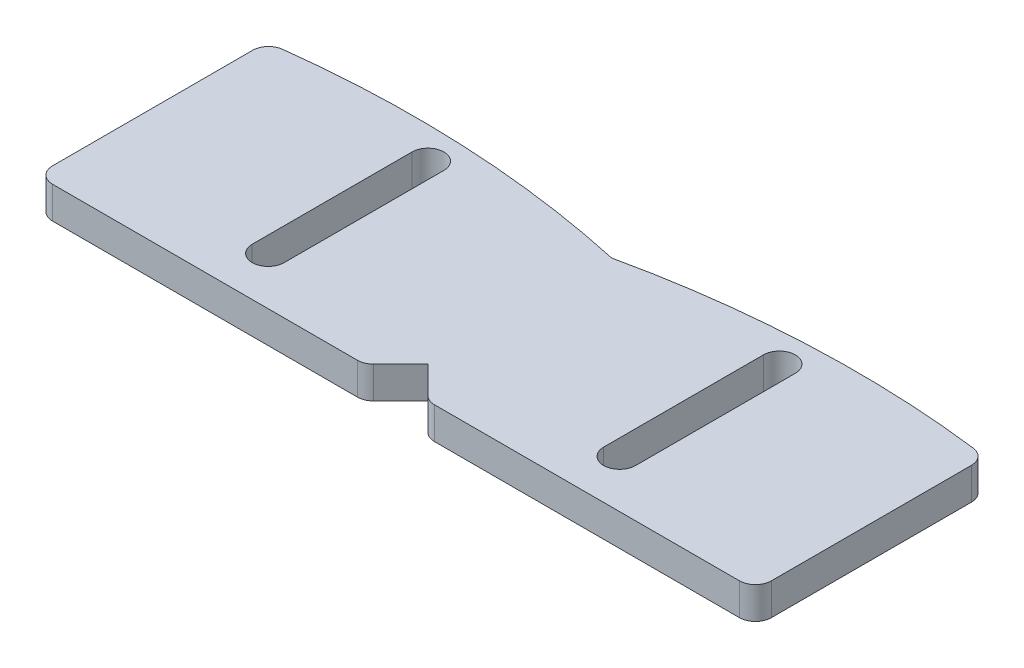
ISO-10303-21;
HEADER;
FILE_DESCRIPTION(('STEP AP214'),'2;1');
FILE_NAME('part.step','',(''),(''),'','','');
FILE_SCHEMA(('AUTOMOTIVE_DESIGN { 1 0 10303 214 1 1 1 1 }'));
ENDSEC;
DATA;
#1=APPLICATION_CONTEXT('core data for automotive mechanical design processes');
#2=APPLICATION_PROTOCOL_DEFINITION('international standard','automotive_design',2000,#1);
#3=PRODUCT_CONTEXT('',#1,'mechanical');
#4=PRODUCT('Part','Part','',(#3));
#5=PRODUCT_RELATED_PRODUCT_CATEGORY('part','',(#4));
#6=PRODUCT_DEFINITION_FORMATION('','',#4);
#7=PRODUCT_DEFINITION_CONTEXT('part definition',#1,'design');
#8=PRODUCT_DEFINITION('design','',#6,#7);
#9=PRODUCT_DEFINITION_SHAPE('','',#8);
#10=(LENGTH_UNIT() NAMED_UNIT(*) SI_UNIT(.MILLI.,.METRE.));
#11=(NAMED_UNIT(*) PLANE_ANGLE_UNIT() SI_UNIT($,.RADIAN.));
#12=(NAMED_UNIT(*) SI_UNIT($,.STERADIAN.) SOLID_ANGLE_UNIT());
#13=UNCERTAINTY_MEASURE_WITH_UNIT(LENGTH_MEASURE(1.E-05),#10,'distance_accuracy_value','');
#14=(GEOMETRIC_REPRESENTATION_CONTEXT(3) GLOBAL_UNCERTAINTY_ASSIGNED_CONTEXT((#13)) GLOBAL_UNIT_ASSIGNED_CONTEXT((#10,
#11,#12)) REPRESENTATION_CONTEXT('',''));
#15=CARTESIAN_POINT('',(0.,0.,0.));
#16=DIRECTION('',(0.,0.,1.));
#17=DIRECTION('',(1.,0.,0.));
#18=AXIS2_PLACEMENT_3D('',#15,#16,#17);
#19=CARTESIAN_POINT('',(12.,2.,0.));
#20=DIRECTION('',(1.,0.,0.));
#21=DIRECTION('',(0.,0.,-1.));
#22=AXIS2_PLACEMENT_3D('',#19,#20,#21);
#23=PLANE('',#22);
#24=DIRECTION('',(0.,0.,1.));
#25=VECTOR('',#24,1.);
#26=CARTESIAN_POINT('',(12.,0.,0.));
#27=LINE('',#26,#25);
#28=CARTESIAN_POINT('',(12.,0.,-5.5));
#29=VERTEX_POINT('',#28);
#30=CARTESIAN_POINT('',(12.,0.,4.5));
#31=VERTEX_POINT('',#30);
#32=EDGE_CURVE('E276',#29,#31,#27,.T.);
#33=ORIENTED_EDGE('',*,*,#32,.T.);
#34=DIRECTION('',(0.,-1.,0.));
#35=VECTOR('',#34,1.);
#36=CARTESIAN_POINT('',(12.,2.,4.5));
#37=LINE('',#36,#35);
#38=CARTESIAN_POINT('',(12.,2.,4.5));
#39=VERTEX_POINT('',#38);
#40=EDGE_CURVE('E294',#39,#31,#37,.T.);
#41=ORIENTED_EDGE('',*,*,#40,.F.);
#42=DIRECTION('',(0.,0.,1.));
#43=VECTOR('',#42,1.);
#44=CARTESIAN_POINT('',(12.,2.,0.));
#45=LINE('',#44,#43);
#46=CARTESIAN_POINT('',(12.,2.,-5.5));
#47=VERTEX_POINT('',#46);
#48=EDGE_CURVE('E234',#47,#39,#45,.T.);
#49=ORIENTED_EDGE('',*,*,#48,.F.);
#50=DIRECTION('',(0.,-1.,0.));
#51=VECTOR('',#50,1.);
#52=CARTESIAN_POINT('',(12.,2.,-5.5));
#53=LINE('',#52,#51);
#54=EDGE_CURVE('E286',#47,#29,#53,.T.);
#55=ORIENTED_EDGE('',*,*,#54,.T.);
#56=EDGE_LOOP('',(#33,#41,#49,#55));
#57=FACE_BOUND('',#56,.T.);
#58=ADVANCED_FACE('F34',(#57),#23,.F.);
#59=CARTESIAN_POINT('',(11.,2.,4.5));
#60=DIRECTION('',(0.,-1.,0.));
#61=DIRECTION('',(0.,0.,-1.));
#62=AXIS2_PLACEMENT_3D('',#59,#60,#61);
#63=CYLINDRICAL_SURFACE('',#62,0.999999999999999);
#64=CARTESIAN_POINT('',(11.,0.,4.5));
#65=DIRECTION('',(0.,1.,0.));
#66=DIRECTION('',(0.,0.,1.));
#67=AXIS2_PLACEMENT_3D('',#64,#65,#66);
#68=CIRCLE('',#67,0.999999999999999);
#69=CARTESIAN_POINT('',(10.,0.,4.5));
#70=VERTEX_POINT('',#69);
#71=EDGE_CURVE('E279',#31,#70,#68,.F.);
#72=ORIENTED_EDGE('',*,*,#71,.T.);
#73=DIRECTION('',(0.,-1.,0.));
#74=VECTOR('',#73,1.);
#75=CARTESIAN_POINT('',(10.,2.,4.5));
#76=LINE('',#75,#74);
#77=CARTESIAN_POINT('',(10.,2.,4.5));
#78=VERTEX_POINT('',#77);
#79=EDGE_CURVE('E292',#78,#70,#76,.T.);
#80=ORIENTED_EDGE('',*,*,#79,.F.);
#81=CARTESIAN_POINT('',(11.,2.,4.5));
#82=DIRECTION('',(0.,1.,0.));
#83=DIRECTION('',(0.,0.,1.));
#84=AXIS2_PLACEMENT_3D('',#81,#82,#83);
#85=CIRCLE('',#84,0.999999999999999);
#86=EDGE_CURVE('E237',#39,#78,#85,.F.);
#87=ORIENTED_EDGE('',*,*,#86,.F.);
#88=ORIENTED_EDGE('',*,*,#40,.T.);
#89=EDGE_LOOP('',(#72,#80,#87,#88));
#90=FACE_BOUND('',#89,.T.);
#91=ADVANCED_FACE('F419',(#90),#63,.F.);
#92=CARTESIAN_POINT('',(10.,2.,0.));
#93=DIRECTION('',(1.,0.,0.));
#94=DIRECTION('',(0.,0.,-1.));
#95=AXIS2_PLACEMENT_3D('',#92,#93,#94);
#96=PLANE('',#95);
#97=DIRECTION('',(0.,0.,1.));
#98=VECTOR('',#97,1.);
#99=CARTESIAN_POINT('',(10.,0.,0.));
#100=LINE('',#99,#98);
#101=CARTESIAN_POINT('',(10.,0.,-5.5));
#102=VERTEX_POINT('',#101);
#103=EDGE_CURVE('E282',#102,#70,#100,.T.);
#104=ORIENTED_EDGE('',*,*,#103,.F.);
#105=DIRECTION('',(0.,-1.,0.));
#106=VECTOR('',#105,1.);
#107=CARTESIAN_POINT('',(10.,2.,-5.5));
#108=LINE('',#107,#106);
#109=CARTESIAN_POINT('',(10.,2.,-5.5));
#110=VERTEX_POINT('',#109);
#111=EDGE_CURVE('E289',#110,#102,#108,.T.);
#112=ORIENTED_EDGE('',*,*,#111,.F.);
#113=DIRECTION('',(0.,0.,1.));
#114=VECTOR('',#113,1.);
#115=CARTESIAN_POINT('',(10.,2.,0.));
#116=LINE('',#115,#114);
#117=EDGE_CURVE('E239',#110,#78,#116,.T.);
#118=ORIENTED_EDGE('',*,*,#117,.T.);
#119=ORIENTED_EDGE('',*,*,#79,.T.);
#120=EDGE_LOOP('',(#104,#112,#118,#119));
#121=FACE_BOUND('',#120,.T.);
#122=ADVANCED_FACE('F425',(#121),#96,.T.);
#123=CARTESIAN_POINT('',(13.763951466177,2.,56.3987866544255));
#124=DIRECTION('',(0.,-1.,0.));
#125=DIRECTION('',(0.,0.,-1.));
#126=AXIS2_PLACEMENT_3D('',#123,#124,#125);
#127=CYLINDRICAL_SURFACE('',#126,63.8987866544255);
#128=CARTESIAN_POINT('',(13.763951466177,2.,56.3987866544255));
#129=DIRECTION('',(0.,1.,0.));
#130=DIRECTION('',(0.,0.,1.));
#131=AXIS2_PLACEMENT_3D('',#128,#129,#130);
#132=CIRCLE('',#131,63.8987866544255);
#133=CARTESIAN_POINT('',(0.,2.,-5.99999999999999));
#134=VERTEX_POINT('',#133);
#135=CARTESIAN_POINT('',(21.622992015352,2.,-7.01485870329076));
#136=VERTEX_POINT('',#135);
#137=EDGE_CURVE('E214',#134,#136,#132,.F.);
#138=ORIENTED_EDGE('',*,*,#137,.T.);
#139=DIRECTION('',(0.,-1.,0.));
#140=VECTOR('',#139,1.);
#141=CARTESIAN_POINT('',(21.622992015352,2.,-7.01485870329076));
#142=LINE('',#141,#140);
#143=CARTESIAN_POINT('',(21.622992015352,0.,-7.01485870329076));
#144=VERTEX_POINT('',#143);
#145=EDGE_CURVE('E42',#136,#144,#142,.T.);
#146=ORIENTED_EDGE('',*,*,#145,.T.);
#147=CARTESIAN_POINT('',(13.763951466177,0.,56.3987866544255));
#148=DIRECTION('',(0.,1.,0.));
#149=DIRECTION('',(0.,0.,1.));
#150=AXIS2_PLACEMENT_3D('',#147,#148,#149);
#151=CIRCLE('',#150,63.8987866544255);
#152=CARTESIAN_POINT('',(0.,0.,-5.99999999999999));
#153=VERTEX_POINT('',#152);
#154=EDGE_CURVE('E254',#153,#144,#151,.F.);
#155=ORIENTED_EDGE('',*,*,#154,.F.);
#156=DIRECTION('',(0.,-1.,0.));
#157=VECTOR('',#156,1.);
#158=CARTESIAN_POINT('',(0.,2.,-5.99999999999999));
#159=LINE('',#158,#157);
#160=EDGE_CURVE('E290',#134,#153,#159,.T.);
#161=ORIENTED_EDGE('',*,*,#160,.F.);
#162=EDGE_LOOP('',(#138,#146,#155,#161));
#163=FACE_BOUND('',#162,.T.);
#164=ADVANCED_FACE('F353',(#163),#127,.T.);
#165=CARTESIAN_POINT('',(-13.763951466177,2.,56.3987866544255));
#166=DIRECTION('',(0.,-1.,0.));
#167=DIRECTION('',(0.,0.,-1.));
#168=AXIS2_PLACEMENT_3D('',#165,#166,#167);
#169=CYLINDRICAL_SURFACE('',#168,63.8987866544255);
#170=CARTESIAN_POINT('',(-13.763951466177,0.,56.3987866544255));
#171=DIRECTION('',(0.,1.,0.));
#172=DIRECTION('',(0.,0.,1.));
#173=AXIS2_PLACEMENT_3D('',#170,#171,#172);
#174=CIRCLE('',#173,63.8987866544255);
#175=CARTESIAN_POINT('',(-21.622992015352,0.,-7.01485870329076));
#176=VERTEX_POINT('',#175);
#177=EDGE_CURVE('E257',#153,#176,#174,.T.);
#178=ORIENTED_EDGE('',*,*,#177,.T.);
#179=DIRECTION('',(0.,-1.,0.));
#180=VECTOR('',#179,1.);
#181=CARTESIAN_POINT('',(-21.622992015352,2.,-7.01485870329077));
#182=LINE('',#181,#180);
#183=CARTESIAN_POINT('',(-21.622992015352,2.,-7.01485870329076));
#184=VERTEX_POINT('',#183);
#185=EDGE_CURVE('E11',#176,#184,#182,.F.);
#186=ORIENTED_EDGE('',*,*,#185,.T.);
#187=CARTESIAN_POINT('',(-13.763951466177,2.,56.3987866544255));
#188=DIRECTION('',(0.,1.,0.));
#189=DIRECTION('',(0.,0.,1.));
#190=AXIS2_PLACEMENT_3D('',#187,#188,#189);
#191=CIRCLE('',#190,63.8987866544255);
#192=EDGE_CURVE('E217',#134,#184,#191,.T.);
#193=ORIENTED_EDGE('',*,*,#192,.F.);
#194=ORIENTED_EDGE('',*,*,#160,.T.);
#195=EDGE_LOOP('',(#178,#186,#193,#194));
#196=FACE_BOUND('',#195,.T.);
#197=ADVANCED_FACE('F365',(#196),#169,.T.);
#198=CARTESIAN_POINT('',(-22.5,2.,0.));
#199=DIRECTION('',(1.,0.,0.));
#200=DIRECTION('',(0.,0.,-1.));
#201=AXIS2_PLACEMENT_3D('',#198,#199,#200);
#202=PLANE('',#201);
#203=DIRECTION('',(0.,0.,1.));
#204=VECTOR('',#203,1.);
#205=CARTESIAN_POINT('',(-22.5,0.,0.));
#206=LINE('',#205,#204);
#207=CARTESIAN_POINT('',(-22.5,0.,-6.02245104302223));
#208=VERTEX_POINT('',#207);
#209=CARTESIAN_POINT('',(-22.5,0.,6.5));
#210=VERTEX_POINT('',#209);
#211=EDGE_CURVE('E260',#208,#210,#206,.T.);
#212=ORIENTED_EDGE('',*,*,#211,.T.);
#213=DIRECTION('',(0.,-1.,0.));
#214=VECTOR('',#213,1.);
#215=CARTESIAN_POINT('',(-22.5,2.,6.5));
#216=LINE('',#215,#214);
#217=CARTESIAN_POINT('',(-22.5,2.,6.5));
#218=VERTEX_POINT('',#217);
#219=EDGE_CURVE('E323',#210,#218,#216,.F.);
#220=ORIENTED_EDGE('',*,*,#219,.T.);
#221=DIRECTION('',(0.,0.,1.));
#222=VECTOR('',#221,1.);
#223=CARTESIAN_POINT('',(-22.5,2.,0.));
#224=LINE('',#223,#222);
#225=CARTESIAN_POINT('',(-22.5,2.,-6.02245104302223));
#226=VERTEX_POINT('',#225);
#227=EDGE_CURVE('E220',#226,#218,#224,.T.);
#228=ORIENTED_EDGE('',*,*,#227,.F.);
#229=DIRECTION('',(0.,-1.,0.));
#230=VECTOR('',#229,1.);
#231=CARTESIAN_POINT('',(-22.5,2.,-6.02245104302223));
#232=LINE('',#231,#230);
#233=EDGE_CURVE('E320',#226,#208,#232,.T.);
#234=ORIENTED_EDGE('',*,*,#233,.T.);
#235=EDGE_LOOP('',(#212,#220,#228,#234));
#236=FACE_BOUND('',#235,.T.);
#237=ADVANCED_FACE('F374',(#236),#202,.F.);
#238=CARTESIAN_POINT('',(0.,2.,7.5));
#239=DIRECTION('',(0.,0.,-1.));
#240=DIRECTION('',(-1.,0.,0.));
#241=AXIS2_PLACEMENT_3D('',#238,#239,#240);
#242=PLANE('',#241);
#243=DIRECTION('',(1.,0.,0.));
#244=VECTOR('',#243,1.);
#245=CARTESIAN_POINT('',(0.,2.,7.5));
#246=LINE('',#245,#244);
#247=CARTESIAN_POINT('',(-21.5,2.,7.5));
#248=VERTEX_POINT('',#247);
#249=CARTESIAN_POINT('',(-2.4142135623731,2.,7.5));
#250=VERTEX_POINT('',#249);
#251=EDGE_CURVE('E223',#248,#250,#246,.T.);
#252=ORIENTED_EDGE('',*,*,#251,.F.);
#253=DIRECTION('',(0.,-1.,0.));
#254=VECTOR('',#253,1.);
#255=CARTESIAN_POINT('',(-21.5,2.,7.5));
#256=LINE('',#255,#254);
#257=CARTESIAN_POINT('',(-21.5,0.,7.5));
#258=VERTEX_POINT('',#257);
#259=EDGE_CURVE('E305',#248,#258,#256,.T.);
#260=ORIENTED_EDGE('',*,*,#259,.T.);
#261=DIRECTION('',(1.,0.,0.));
#262=VECTOR('',#261,1.);
#263=CARTESIAN_POINT('',(0.,0.,7.5));
#264=LINE('',#263,#262);
#265=CARTESIAN_POINT('',(-2.4142135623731,0.,7.5));
#266=VERTEX_POINT('',#265);
#267=EDGE_CURVE('E263',#258,#266,#264,.T.);
#268=ORIENTED_EDGE('',*,*,#267,.T.);
#269=DIRECTION('',(0.,-1.,0.));
#270=VECTOR('',#269,1.);
#271=CARTESIAN_POINT('',(-2.4142135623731,2.,7.5));
#272=LINE('',#271,#270);
#273=EDGE_CURVE('E297',#266,#250,#272,.F.);
#274=ORIENTED_EDGE('',*,*,#273,.T.);
#275=EDGE_LOOP('',(#252,#260,#268,#274));
#276=FACE_BOUND('',#275,.T.);
#277=ADVANCED_FACE('F383',(#276),#242,.F.);
#278=CARTESIAN_POINT('',(2.75,2.,2.75));
#279=DIRECTION('',(0.707106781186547,0.,0.707106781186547));
#280=DIRECTION('',(0.707106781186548,0.,-0.707106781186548));
#281=AXIS2_PLACEMENT_3D('',#278,#279,#280);
#282=PLANE('',#281);
#283=DIRECTION('',(-0.707106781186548,0.,0.707106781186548));
#284=VECTOR('',#283,1.);
#285=CARTESIAN_POINT('',(2.75,2.,2.75));
#286=LINE('',#285,#284);
#287=CARTESIAN_POINT('',(0.,2.,5.5));
#288=VERTEX_POINT('',#287);
#289=CARTESIAN_POINT('',(-1.70710678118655,2.,7.20710678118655));
#290=VERTEX_POINT('',#289);
#291=EDGE_CURVE('E228',#288,#290,#286,.T.);
#292=ORIENTED_EDGE('',*,*,#291,.T.);
#293=DIRECTION('',(0.,-1.,0.));
#294=VECTOR('',#293,1.);
#295=CARTESIAN_POINT('',(-1.70710678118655,0.,7.20710678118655));
#296=LINE('',#295,#294);
#297=CARTESIAN_POINT('',(-1.70710678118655,0.,7.20710678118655));
#298=VERTEX_POINT('',#297);
#299=EDGE_CURVE('E336',#290,#298,#296,.T.);
#300=ORIENTED_EDGE('',*,*,#299,.T.);
#301=DIRECTION('',(-0.707106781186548,0.,0.707106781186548));
#302=VECTOR('',#301,1.);
#303=CARTESIAN_POINT('',(2.75,0.,2.75));
#304=LINE('',#303,#302);
#305=CARTESIAN_POINT('',(0.,0.,5.5));
#306=VERTEX_POINT('',#305);
#307=EDGE_CURVE('E269',#306,#298,#304,.T.);
#308=ORIENTED_EDGE('',*,*,#307,.F.);
#309=DIRECTION('',(0.,-1.,0.));
#310=VECTOR('',#309,1.);
#311=CARTESIAN_POINT('',(0.,2.,5.5));
#312=LINE('',#311,#310);
#313=EDGE_CURVE('E194',#288,#306,#312,.T.);
#314=ORIENTED_EDGE('',*,*,#313,.F.);
#315=EDGE_LOOP('',(#292,#300,#308,#314));
#316=FACE_BOUND('',#315,.T.);
#317=ADVANCED_FACE('F391',(#316),#282,.T.);
#318=CARTESIAN_POINT('',(-2.75,2.,2.75));
#319=DIRECTION('',(0.707106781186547,0.,-0.707106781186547));
#320=DIRECTION('',(-0.707106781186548,0.,-0.707106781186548));
#321=AXIS2_PLACEMENT_3D('',#318,#319,#320);
#322=PLANE('',#321);
#323=DIRECTION('',(0.707106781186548,0.,0.707106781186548));
#324=VECTOR('',#323,1.);
#325=CARTESIAN_POINT('',(-2.75,0.,2.75));
#326=LINE('',#325,#324);
#327=CARTESIAN_POINT('',(1.70710678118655,0.,7.20710678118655));
#328=VERTEX_POINT('',#327);
#329=EDGE_CURVE('E268',#306,#328,#326,.T.);
#330=ORIENTED_EDGE('',*,*,#329,.T.);
#331=DIRECTION('',(0.,-1.,0.));
#332=VECTOR('',#331,1.);
#333=CARTESIAN_POINT('',(1.70710678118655,2.,7.20710678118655));
#334=LINE('',#333,#332);
#335=CARTESIAN_POINT('',(1.70710678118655,2.,7.20710678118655));
#336=VERTEX_POINT('',#335);
#337=EDGE_CURVE('E344',#328,#336,#334,.F.);
#338=ORIENTED_EDGE('',*,*,#337,.T.);
#339=DIRECTION('',(0.707106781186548,0.,0.707106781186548));
#340=VECTOR('',#339,1.);
#341=CARTESIAN_POINT('',(-2.75,2.,2.75));
#342=LINE('',#341,#340);
#343=EDGE_CURVE('E227',#288,#336,#342,.T.);
#344=ORIENTED_EDGE('',*,*,#343,.F.);
#345=ORIENTED_EDGE('',*,*,#313,.T.);
#346=EDGE_LOOP('',(#330,#338,#344,#345));
#347=FACE_BOUND('',#346,.T.);
#348=ADVANCED_FACE('F396',(#347),#322,.F.);
#349=CARTESIAN_POINT('',(2.4142135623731,2.,7.5));
#350=VERTEX_POINT('',#349);
#351=CARTESIAN_POINT('',(21.5,2.,7.5));
#352=VERTEX_POINT('',#351);
#353=EDGE_CURVE('E224',#350,#352,#246,.T.);
#354=ORIENTED_EDGE('',*,*,#353,.F.);
#355=DIRECTION('',(0.,-1.,0.));
#356=VECTOR('',#355,1.);
#357=CARTESIAN_POINT('',(2.4142135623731,2.,7.5));
#358=LINE('',#357,#356);
#359=CARTESIAN_POINT('',(2.4142135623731,0.,7.5));
#360=VERTEX_POINT('',#359);
#361=EDGE_CURVE('E341',#350,#360,#358,.T.);
#362=ORIENTED_EDGE('',*,*,#361,.T.);
#363=CARTESIAN_POINT('',(21.5,0.,7.5));
#364=VERTEX_POINT('',#363);
#365=EDGE_CURVE('E264',#360,#364,#264,.T.);
#366=ORIENTED_EDGE('',*,*,#365,.T.);
#367=DIRECTION('',(0.,-1.,0.));
#368=VECTOR('',#367,1.);
#369=CARTESIAN_POINT('',(21.5,2.,7.5));
#370=LINE('',#369,#368);
#371=EDGE_CURVE('E339',#364,#352,#370,.F.);
#372=ORIENTED_EDGE('',*,*,#371,.T.);
#373=EDGE_LOOP('',(#354,#362,#366,#372));
#374=FACE_BOUND('',#373,.T.);
#375=ADVANCED_FACE('F405',(#374),#242,.F.);
#376=CARTESIAN_POINT('',(-11.,2.,4.5));
#377=DIRECTION('',(0.,-1.,0.));
#378=DIRECTION('',(0.,0.,-1.));
#379=AXIS2_PLACEMENT_3D('',#376,#377,#378);
#380=CYLINDRICAL_SURFACE('',#379,0.999999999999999);
#381=CARTESIAN_POINT('',(-11.,0.,4.5));
#382=DIRECTION('',(0.,1.,0.));
#383=DIRECTION('',(0.,0.,1.));
#384=AXIS2_PLACEMENT_3D('',#381,#382,#383);
#385=CIRCLE('',#384,0.999999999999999);
#386=CARTESIAN_POINT('',(-12.,0.,4.5));
#387=VERTEX_POINT('',#386);
#388=CARTESIAN_POINT('',(-10.,0.,4.5));
#389=VERTEX_POINT('',#388);
#390=EDGE_CURVE('E189',#387,#389,#385,.T.);
#391=ORIENTED_EDGE('',*,*,#390,.F.);
#392=DIRECTION('',(0.,-1.,0.));
#393=VECTOR('',#392,1.);
#394=CARTESIAN_POINT('',(-12.,2.,4.5));
#395=LINE('',#394,#393);
#396=CARTESIAN_POINT('',(-12.,2.,4.5));
#397=VERTEX_POINT('',#396);
#398=EDGE_CURVE('E184',#397,#387,#395,.T.);
#399=ORIENTED_EDGE('',*,*,#398,.F.);
#400=CARTESIAN_POINT('',(-11.,2.,4.5));
#401=DIRECTION('',(0.,1.,0.));
#402=DIRECTION('',(0.,0.,1.));
#403=AXIS2_PLACEMENT_3D('',#400,#401,#402);
#404=CIRCLE('',#403,0.999999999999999);
#405=CARTESIAN_POINT('',(-10.,2.,4.5));
#406=VERTEX_POINT('',#405);
#407=EDGE_CURVE('E187',#397,#406,#404,.T.);
#408=ORIENTED_EDGE('',*,*,#407,.T.);
#409=DIRECTION('',(0.,-1.,0.));
#410=VECTOR('',#409,1.);
#411=CARTESIAN_POINT('',(-10.,2.,4.5));
#412=LINE('',#411,#410);
#413=EDGE_CURVE('E244',#406,#389,#412,.T.);
#414=ORIENTED_EDGE('',*,*,#413,.T.);
#415=EDGE_LOOP('',(#391,#399,#408,#414));
#416=FACE_BOUND('',#415,.T.);
#417=ADVANCED_FACE('F186',(#416),#380,.F.);
#418=CARTESIAN_POINT('',(-12.,2.,0.));
#419=DIRECTION('',(1.,0.,0.));
#420=DIRECTION('',(0.,0.,-1.));
#421=AXIS2_PLACEMENT_3D('',#418,#419,#420);
#422=PLANE('',#421);
#423=DIRECTION('',(0.,0.,1.));
#424=VECTOR('',#423,1.);
#425=CARTESIAN_POINT('',(-12.,0.,0.));
#426=LINE('',#425,#424);
#427=CARTESIAN_POINT('',(-12.,0.,-5.5));
#428=VERTEX_POINT('',#427);
#429=EDGE_CURVE('E246',#428,#387,#426,.T.);
#430=ORIENTED_EDGE('',*,*,#429,.F.);
#431=DIRECTION('',(0.,-1.,0.));
#432=VECTOR('',#431,1.);
#433=CARTESIAN_POINT('',(-12.,2.,-5.5));
#434=LINE('',#433,#432);
#435=CARTESIAN_POINT('',(-12.,2.,-5.5));
#436=VERTEX_POINT('',#435);
#437=EDGE_CURVE('E195',#436,#428,#434,.T.);
#438=ORIENTED_EDGE('',*,*,#437,.F.);
#439=DIRECTION('',(0.,0.,1.));
#440=VECTOR('',#439,1.);
#441=CARTESIAN_POINT('',(-12.,2.,0.));
#442=LINE('',#441,#440);
#443=EDGE_CURVE('E201',#436,#397,#442,.T.);
#444=ORIENTED_EDGE('',*,*,#443,.T.);
#445=ORIENTED_EDGE('',*,*,#398,.T.);
#446=EDGE_LOOP('',(#430,#438,#444,#445));
#447=FACE_BOUND('',#446,.T.);
#448=ADVANCED_FACE('F208',(#447),#422,.T.);
#449=CARTESIAN_POINT('',(-11.,2.,-5.5));
#450=DIRECTION('',(0.,-1.,0.));
#451=DIRECTION('',(0.,0.,-1.));
#452=AXIS2_PLACEMENT_3D('',#449,#450,#451);
#453=CYLINDRICAL_SURFACE('',#452,1.);
#454=CARTESIAN_POINT('',(-11.,0.,-5.5));
#455=DIRECTION('',(0.,1.,0.));
#456=DIRECTION('',(0.,0.,1.));
#457=AXIS2_PLACEMENT_3D('',#454,#455,#456);
#458=CIRCLE('',#457,1.);
#459=CARTESIAN_POINT('',(-10.,0.,-5.5));
#460=VERTEX_POINT('',#459);
#461=EDGE_CURVE('E248',#460,#428,#458,.T.);
#462=ORIENTED_EDGE('',*,*,#461,.F.);
#463=DIRECTION('',(0.,-1.,0.));
#464=VECTOR('',#463,1.);
#465=CARTESIAN_POINT('',(-10.,2.,-5.5));
#466=LINE('',#465,#464);
#467=CARTESIAN_POINT('',(-10.,2.,-5.5));
#468=VERTEX_POINT('',#467);
#469=EDGE_CURVE('E301',#468,#460,#466,.T.);
#470=ORIENTED_EDGE('',*,*,#469,.F.);
#471=CARTESIAN_POINT('',(-11.,2.,-5.5));
#472=DIRECTION('',(0.,1.,0.));
#473=DIRECTION('',(0.,0.,1.));
#474=AXIS2_PLACEMENT_3D('',#471,#472,#473);
#475=CIRCLE('',#474,1.);
#476=EDGE_CURVE('E209',#468,#436,#475,.T.);
#477=ORIENTED_EDGE('',*,*,#476,.T.);
#478=ORIENTED_EDGE('',*,*,#437,.T.);
#479=EDGE_LOOP('',(#462,#470,#477,#478));
#480=FACE_BOUND('',#479,.T.);
#481=ADVANCED_FACE('F433',(#480),#453,.F.);
#482=CARTESIAN_POINT('',(22.5,2.,0.));
#483=DIRECTION('',(1.,0.,0.));
#484=DIRECTION('',(0.,0.,-1.));
#485=AXIS2_PLACEMENT_3D('',#482,#483,#484);
#486=PLANE('',#485);
#487=DIRECTION('',(0.,0.,1.));
#488=VECTOR('',#487,1.);
#489=CARTESIAN_POINT('',(22.5,2.,0.));
#490=LINE('',#489,#488);
#491=CARTESIAN_POINT('',(22.5,2.,-6.02245104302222));
#492=VERTEX_POINT('',#491);
#493=CARTESIAN_POINT('',(22.5,2.,6.5));
#494=VERTEX_POINT('',#493);
#495=EDGE_CURVE('E226',#492,#494,#490,.T.);
#496=ORIENTED_EDGE('',*,*,#495,.T.);
#497=DIRECTION('',(0.,-1.,0.));
#498=VECTOR('',#497,1.);
#499=CARTESIAN_POINT('',(22.5,0.,6.5));
#500=LINE('',#499,#498);
#501=CARTESIAN_POINT('',(22.5,0.,6.5));
#502=VERTEX_POINT('',#501);
#503=EDGE_CURVE('E347',#494,#502,#500,.T.);
#504=ORIENTED_EDGE('',*,*,#503,.T.);
#505=DIRECTION('',(0.,0.,1.));
#506=VECTOR('',#505,1.);
#507=CARTESIAN_POINT('',(22.5,0.,0.));
#508=LINE('',#507,#506);
#509=CARTESIAN_POINT('',(22.5,0.,-6.02245104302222));
#510=VERTEX_POINT('',#509);
#511=EDGE_CURVE('E267',#510,#502,#508,.T.);
#512=ORIENTED_EDGE('',*,*,#511,.F.);
#513=DIRECTION('',(0.,-1.,0.));
#514=VECTOR('',#513,1.);
#515=CARTESIAN_POINT('',(22.5,2.,-6.02245104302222));
#516=LINE('',#515,#514);
#517=EDGE_CURVE('E56',#510,#492,#516,.F.);
#518=ORIENTED_EDGE('',*,*,#517,.T.);
#519=EDGE_LOOP('',(#496,#504,#512,#518));
#520=FACE_BOUND('',#519,.T.);
#521=ADVANCED_FACE('F410',(#520),#486,.T.);
#522=CARTESIAN_POINT('',(-10.,2.,0.));
#523=DIRECTION('',(1.,0.,0.));
#524=DIRECTION('',(0.,0.,-1.));
#525=AXIS2_PLACEMENT_3D('',#522,#523,#524);
#526=PLANE('',#525);
#527=DIRECTION('',(0.,0.,1.));
#528=VECTOR('',#527,1.);
#529=CARTESIAN_POINT('',(-10.,0.,0.));
#530=LINE('',#529,#528);
#531=EDGE_CURVE('E251',#460,#389,#530,.T.);
#532=ORIENTED_EDGE('',*,*,#531,.T.);
#533=ORIENTED_EDGE('',*,*,#413,.F.);
#534=DIRECTION('',(0.,0.,1.));
#535=VECTOR('',#534,1.);
#536=CARTESIAN_POINT('',(-10.,2.,0.));
#537=LINE('',#536,#535);
#538=EDGE_CURVE('E204',#468,#406,#537,.T.);
#539=ORIENTED_EDGE('',*,*,#538,.F.);
#540=ORIENTED_EDGE('',*,*,#469,.T.);
#541=EDGE_LOOP('',(#532,#533,#539,#540));
#542=FACE_BOUND('',#541,.T.);
#543=ADVANCED_FACE('F432',(#542),#526,.F.);
#544=CARTESIAN_POINT('',(11.,2.,-5.5));
#545=DIRECTION('',(0.,-1.,0.));
#546=DIRECTION('',(0.,0.,-1.));
#547=AXIS2_PLACEMENT_3D('',#544,#545,#546);
#548=CYLINDRICAL_SURFACE('',#547,1.);
#549=CARTESIAN_POINT('',(11.,0.,-5.5));
#550=DIRECTION('',(0.,1.,0.));
#551=DIRECTION('',(0.,0.,1.));
#552=AXIS2_PLACEMENT_3D('',#549,#550,#551);
#553=CIRCLE('',#552,1.);
#554=EDGE_CURVE('E206',#102,#29,#553,.F.);
#555=ORIENTED_EDGE('',*,*,#554,.T.);
#556=ORIENTED_EDGE('',*,*,#54,.F.);
#557=CARTESIAN_POINT('',(11.,2.,-5.5));
#558=DIRECTION('',(0.,1.,0.));
#559=DIRECTION('',(0.,0.,1.));
#560=AXIS2_PLACEMENT_3D('',#557,#558,#559);
#561=CIRCLE('',#560,1.);
#562=EDGE_CURVE('E242',#110,#47,#561,.F.);
#563=ORIENTED_EDGE('',*,*,#562,.F.);
#564=ORIENTED_EDGE('',*,*,#111,.T.);
#565=EDGE_LOOP('',(#555,#556,#563,#564));
#566=FACE_BOUND('',#565,.T.);
#567=ADVANCED_FACE('F448',(#566),#548,.F.);
#568=CARTESIAN_POINT('',(0.,2.,0.));
#569=DIRECTION('',(0.,1.,0.));
#570=DIRECTION('',(0.,0.,1.));
#571=AXIS2_PLACEMENT_3D('',#568,#569,#570);
#572=PLANE('',#571);
#573=ORIENTED_EDGE('',*,*,#407,.F.);
#574=ORIENTED_EDGE('',*,*,#443,.F.);
#575=ORIENTED_EDGE('',*,*,#476,.F.);
#576=ORIENTED_EDGE('',*,*,#538,.T.);
#577=EDGE_LOOP('',(#573,#574,#575,#576));
#578=FACE_BOUND('',#577,.T.);
#579=ORIENTED_EDGE('',*,*,#227,.T.);
#580=CARTESIAN_POINT('',(-21.5,2.,6.5));
#581=DIRECTION('',(0.,1.,0.));
#582=DIRECTION('',(0.,0.,1.));
#583=AXIS2_PLACEMENT_3D('',#580,#581,#582);
#584=CIRCLE('',#583,1.);
#585=EDGE_CURVE('E334',#218,#248,#584,.T.);
#586=ORIENTED_EDGE('',*,*,#585,.T.);
#587=ORIENTED_EDGE('',*,*,#251,.T.);
#588=CARTESIAN_POINT('',(-2.4142135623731,2.,6.5));
#589=DIRECTION('',(0.,1.,0.));
#590=DIRECTION('',(0.,0.,1.));
#591=AXIS2_PLACEMENT_3D('',#588,#589,#590);
#592=CIRCLE('',#591,1.);
#593=EDGE_CURVE('E332',#250,#290,#592,.T.);
#594=ORIENTED_EDGE('',*,*,#593,.T.);
#595=ORIENTED_EDGE('',*,*,#291,.F.);
#596=ORIENTED_EDGE('',*,*,#343,.T.);
#597=CARTESIAN_POINT('',(2.4142135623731,2.,6.5));
#598=DIRECTION('',(0.,1.,0.));
#599=DIRECTION('',(0.,0.,1.));
#600=AXIS2_PLACEMENT_3D('',#597,#598,#599);
#601=CIRCLE('',#600,1.);
#602=EDGE_CURVE('E330',#336,#350,#601,.T.);
#603=ORIENTED_EDGE('',*,*,#602,.T.);
#604=ORIENTED_EDGE('',*,*,#353,.T.);
#605=CARTESIAN_POINT('',(21.5,2.,6.5));
#606=DIRECTION('',(0.,1.,0.));
#607=DIRECTION('',(0.,0.,1.));
#608=AXIS2_PLACEMENT_3D('',#605,#606,#607);
#609=CIRCLE('',#608,1.);
#610=EDGE_CURVE('E49',#352,#494,#609,.T.);
#611=ORIENTED_EDGE('',*,*,#610,.T.);
#612=ORIENTED_EDGE('',*,*,#495,.F.);
#613=CARTESIAN_POINT('',(21.5,2.,-6.02245104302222));
#614=DIRECTION('',(0.,1.,0.));
#615=DIRECTION('',(0.,0.,1.));
#616=AXIS2_PLACEMENT_3D('',#613,#614,#615);
#617=CIRCLE('',#616,1.);
#618=EDGE_CURVE('E327',#492,#136,#617,.T.);
#619=ORIENTED_EDGE('',*,*,#618,.T.);
#620=ORIENTED_EDGE('',*,*,#137,.F.);
#621=ORIENTED_EDGE('',*,*,#192,.T.);
#622=CARTESIAN_POINT('',(-21.5,2.,-6.02245104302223));
#623=DIRECTION('',(0.,1.,0.));
#624=DIRECTION('',(0.,0.,1.));
#625=AXIS2_PLACEMENT_3D('',#622,#623,#624);
#626=CIRCLE('',#625,1.);
#627=EDGE_CURVE('E325',#184,#226,#626,.T.);
#628=ORIENTED_EDGE('',*,*,#627,.T.);
#629=EDGE_LOOP('',(#579,#586,#587,#594,#595,#596,#603,#604,#611,#612,#619,#620,#621,#628));
#630=FACE_BOUND('',#629,.T.);
#631=ORIENTED_EDGE('',*,*,#48,.T.);
#632=ORIENTED_EDGE('',*,*,#86,.T.);
#633=ORIENTED_EDGE('',*,*,#117,.F.);
#634=ORIENTED_EDGE('',*,*,#562,.T.);
#635=EDGE_LOOP('',(#631,#632,#633,#634));
#636=FACE_BOUND('',#635,.T.);
#637=ADVANCED_FACE('F199',(#578,#630,#636),#572,.T.);
#638=CARTESIAN_POINT('',(0.,0.,0.));
#639=DIRECTION('',(0.,1.,0.));
#640=DIRECTION('',(0.,0.,1.));
#641=AXIS2_PLACEMENT_3D('',#638,#639,#640);
#642=PLANE('',#641);
#643=ORIENTED_EDGE('',*,*,#390,.T.);
#644=ORIENTED_EDGE('',*,*,#531,.F.);
#645=ORIENTED_EDGE('',*,*,#461,.T.);
#646=ORIENTED_EDGE('',*,*,#429,.T.);
#647=EDGE_LOOP('',(#643,#644,#645,#646));
#648=FACE_BOUND('',#647,.T.);
#649=ORIENTED_EDGE('',*,*,#267,.F.);
#650=CARTESIAN_POINT('',(-21.5,0.,6.5));
#651=DIRECTION('',(0.,1.,0.));
#652=DIRECTION('',(0.,0.,1.));
#653=AXIS2_PLACEMENT_3D('',#650,#651,#652);
#654=CIRCLE('',#653,1.);
#655=EDGE_CURVE('E318',#258,#210,#654,.F.);
#656=ORIENTED_EDGE('',*,*,#655,.T.);
#657=ORIENTED_EDGE('',*,*,#211,.F.);
#658=CARTESIAN_POINT('',(-21.5,0.,-6.02245104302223));
#659=DIRECTION('',(0.,1.,0.));
#660=DIRECTION('',(0.,0.,1.));
#661=AXIS2_PLACEMENT_3D('',#658,#659,#660);
#662=CIRCLE('',#661,1.);
#663=EDGE_CURVE('E308',#208,#176,#662,.F.);
#664=ORIENTED_EDGE('',*,*,#663,.T.);
#665=ORIENTED_EDGE('',*,*,#177,.F.);
#666=ORIENTED_EDGE('',*,*,#154,.T.);
#667=CARTESIAN_POINT('',(21.5,0.,-6.02245104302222));
#668=DIRECTION('',(0.,1.,0.));
#669=DIRECTION('',(0.,0.,1.));
#670=AXIS2_PLACEMENT_3D('',#667,#668,#669);
#671=CIRCLE('',#670,1.);
#672=EDGE_CURVE('E310',#144,#510,#671,.F.);
#673=ORIENTED_EDGE('',*,*,#672,.T.);
#674=ORIENTED_EDGE('',*,*,#511,.T.);
#675=CARTESIAN_POINT('',(21.5,0.,6.5));
#676=DIRECTION('',(0.,1.,0.));
#677=DIRECTION('',(0.,0.,1.));
#678=AXIS2_PLACEMENT_3D('',#675,#676,#677);
#679=CIRCLE('',#678,1.);
#680=EDGE_CURVE('E312',#502,#364,#679,.F.);
#681=ORIENTED_EDGE('',*,*,#680,.T.);
#682=ORIENTED_EDGE('',*,*,#365,.F.);
#683=CARTESIAN_POINT('',(2.4142135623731,0.,6.5));
#684=DIRECTION('',(0.,1.,0.));
#685=DIRECTION('',(0.,0.,1.));
#686=AXIS2_PLACEMENT_3D('',#683,#684,#685);
#687=CIRCLE('',#686,1.);
#688=EDGE_CURVE('E314',#360,#328,#687,.F.);
#689=ORIENTED_EDGE('',*,*,#688,.T.);
#690=ORIENTED_EDGE('',*,*,#329,.F.);
#691=ORIENTED_EDGE('',*,*,#307,.T.);
#692=CARTESIAN_POINT('',(-2.4142135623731,0.,6.5));
#693=DIRECTION('',(0.,1.,0.));
#694=DIRECTION('',(0.,0.,1.));
#695=AXIS2_PLACEMENT_3D('',#692,#693,#694);
#696=CIRCLE('',#695,1.);
#697=EDGE_CURVE('E316',#298,#266,#696,.F.);
#698=ORIENTED_EDGE('',*,*,#697,.T.);
#699=EDGE_LOOP('',(#649,#656,#657,#664,#665,#666,#673,#674,#681,#682,#689,#690,#691,#698));
#700=FACE_BOUND('',#699,.T.);
#701=ORIENTED_EDGE('',*,*,#32,.F.);
#702=ORIENTED_EDGE('',*,*,#554,.F.);
#703=ORIENTED_EDGE('',*,*,#103,.T.);
#704=ORIENTED_EDGE('',*,*,#71,.F.);
#705=EDGE_LOOP('',(#701,#702,#703,#704));
#706=FACE_BOUND('',#705,.T.);
#707=ADVANCED_FACE('F360',(#648,#700,#706),#642,.F.);
#708=CARTESIAN_POINT('',(-21.5,2.,6.5));
#709=DIRECTION('',(0.,-1.,0.));
#710=DIRECTION('',(0.,0.,-1.));
#711=AXIS2_PLACEMENT_3D('',#708,#709,#710);
#712=CYLINDRICAL_SURFACE('',#711,1.);
#713=ORIENTED_EDGE('',*,*,#585,.F.);
#714=ORIENTED_EDGE('',*,*,#219,.F.);
#715=ORIENTED_EDGE('',*,*,#655,.F.);
#716=ORIENTED_EDGE('',*,*,#259,.F.);
#717=EDGE_LOOP('',(#713,#714,#715,#716));
#718=FACE_BOUND('',#717,.T.);
#719=ADVANCED_FACE('F377',(#718),#712,.T.);
#720=CARTESIAN_POINT('',(-2.4142135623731,2.,6.5));
#721=DIRECTION('',(0.,1.,0.));
#722=DIRECTION('',(0.,0.,1.));
#723=AXIS2_PLACEMENT_3D('',#720,#721,#722);
#724=CYLINDRICAL_SURFACE('',#723,1.);
#725=ORIENTED_EDGE('',*,*,#593,.F.);
#726=ORIENTED_EDGE('',*,*,#273,.F.);
#727=ORIENTED_EDGE('',*,*,#697,.F.);
#728=ORIENTED_EDGE('',*,*,#299,.F.);
#729=EDGE_LOOP('',(#725,#726,#727,#728));
#730=FACE_BOUND('',#729,.T.);
#731=ADVANCED_FACE('F387',(#730),#724,.T.);
#732=CARTESIAN_POINT('',(2.4142135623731,2.,6.5));
#733=DIRECTION('',(0.,-1.,0.));
#734=DIRECTION('',(0.,0.,-1.));
#735=AXIS2_PLACEMENT_3D('',#732,#733,#734);
#736=CYLINDRICAL_SURFACE('',#735,1.);
#737=ORIENTED_EDGE('',*,*,#602,.F.);
#738=ORIENTED_EDGE('',*,*,#337,.F.);
#739=ORIENTED_EDGE('',*,*,#688,.F.);
#740=ORIENTED_EDGE('',*,*,#361,.F.);
#741=EDGE_LOOP('',(#737,#738,#739,#740));
#742=FACE_BOUND('',#741,.T.);
#743=ADVANCED_FACE('F402',(#742),#736,.T.);
#744=CARTESIAN_POINT('',(21.5,2.,6.5));
#745=DIRECTION('',(0.,1.,0.));
#746=DIRECTION('',(0.,0.,1.));
#747=AXIS2_PLACEMENT_3D('',#744,#745,#746);
#748=CYLINDRICAL_SURFACE('',#747,1.);
#749=ORIENTED_EDGE('',*,*,#610,.F.);
#750=ORIENTED_EDGE('',*,*,#371,.F.);
#751=ORIENTED_EDGE('',*,*,#680,.F.);
#752=ORIENTED_EDGE('',*,*,#503,.F.);
#753=EDGE_LOOP('',(#749,#750,#751,#752));
#754=FACE_BOUND('',#753,.T.);
#755=ADVANCED_FACE('F409',(#754),#748,.T.);
#756=CARTESIAN_POINT('',(21.5,2.,-6.02245104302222));
#757=DIRECTION('',(0.,-1.,0.));
#758=DIRECTION('',(0.,0.,-1.));
#759=AXIS2_PLACEMENT_3D('',#756,#757,#758);
#760=CYLINDRICAL_SURFACE('',#759,1.);
#761=ORIENTED_EDGE('',*,*,#618,.F.);
#762=ORIENTED_EDGE('',*,*,#517,.F.);
#763=ORIENTED_EDGE('',*,*,#672,.F.);
#764=ORIENTED_EDGE('',*,*,#145,.F.);
#765=EDGE_LOOP('',(#761,#762,#763,#764));
#766=FACE_BOUND('',#765,.T.);
#767=ADVANCED_FACE('F411',(#766),#760,.T.);
#768=CARTESIAN_POINT('',(-21.5,2.,-6.02245104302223));
#769=DIRECTION('',(0.,-1.,0.));
#770=DIRECTION('',(0.,0.,-1.));
#771=AXIS2_PLACEMENT_3D('',#768,#769,#770);
#772=CYLINDRICAL_SURFACE('',#771,1.);
#773=ORIENTED_EDGE('',*,*,#627,.F.);
#774=ORIENTED_EDGE('',*,*,#185,.F.);
#775=ORIENTED_EDGE('',*,*,#663,.F.);
#776=ORIENTED_EDGE('',*,*,#233,.F.);
#777=EDGE_LOOP('',(#773,#774,#775,#776));
#778=FACE_BOUND('',#777,.T.);
#779=ADVANCED_FACE('F36',(#778),#772,.T.);
#780=CLOSED_SHELL('',(#58,#91,#122,#164,#197,#237,#277,#317,#348,#375,#417,#448,#481,#521,#543,
#567,#637,#707,#719,#731,#743,#755,#767,#779));
#781=MANIFOLD_SOLID_BREP('B2',#780);
#782=ADVANCED_BREP_SHAPE_REPRESENTATION('',(#18,#781),#14);
#783=SHAPE_DEFINITION_REPRESENTATION(#9,#782);
ENDSEC;
END-ISO-10303-21;
